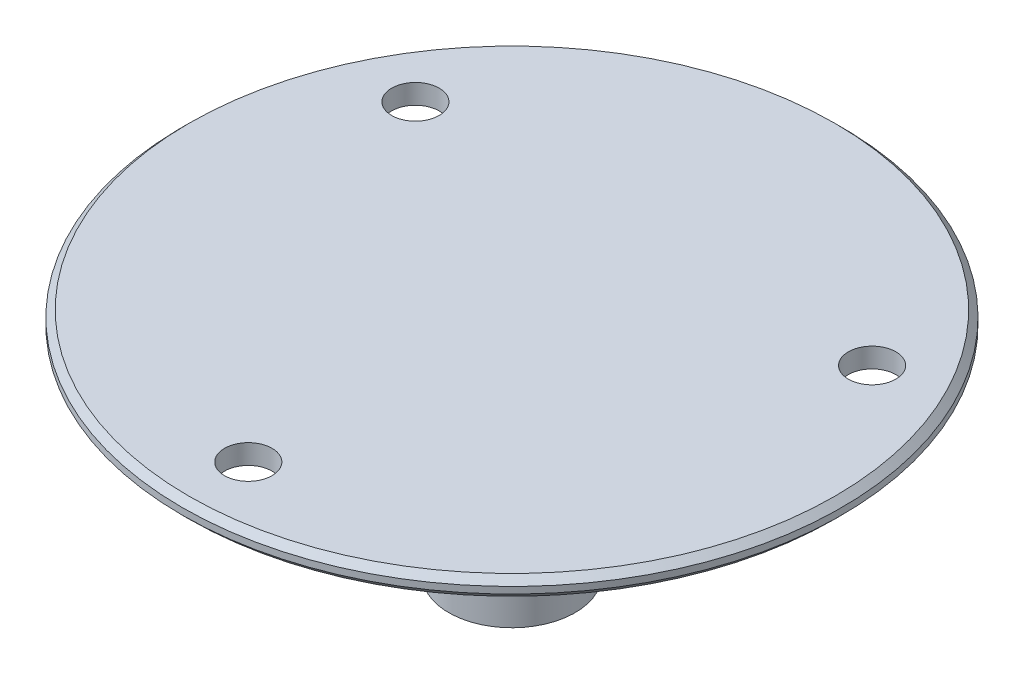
ISO-10303-21;
HEADER;
FILE_DESCRIPTION(('STEP AP214'),'2;1');
FILE_NAME('part.step','',(''),(''),'','','');
FILE_SCHEMA(('AUTOMOTIVE_DESIGN { 1 0 10303 214 1 1 1 1 }'));
ENDSEC;
DATA;
#1=APPLICATION_CONTEXT('core data for automotive mechanical design processes');
#2=APPLICATION_PROTOCOL_DEFINITION('international standard','automotive_design',2000,#1);
#3=PRODUCT_CONTEXT('',#1,'mechanical');
#4=PRODUCT('Part','Part','',(#3));
#5=PRODUCT_RELATED_PRODUCT_CATEGORY('part','',(#4));
#6=PRODUCT_DEFINITION_FORMATION('','',#4);
#7=PRODUCT_DEFINITION_CONTEXT('part definition',#1,'design');
#8=PRODUCT_DEFINITION('design','',#6,#7);
#9=PRODUCT_DEFINITION_SHAPE('','',#8);
#10=(LENGTH_UNIT() NAMED_UNIT(*) SI_UNIT(.MILLI.,.METRE.));
#11=(NAMED_UNIT(*) PLANE_ANGLE_UNIT() SI_UNIT($,.RADIAN.));
#12=(NAMED_UNIT(*) SI_UNIT($,.STERADIAN.) SOLID_ANGLE_UNIT());
#13=UNCERTAINTY_MEASURE_WITH_UNIT(LENGTH_MEASURE(1.E-05),#10,'distance_accuracy_value','');
#14=(GEOMETRIC_REPRESENTATION_CONTEXT(3) GLOBAL_UNCERTAINTY_ASSIGNED_CONTEXT((#13)) GLOBAL_UNIT_ASSIGNED_CONTEXT((#10,
#11,#12)) REPRESENTATION_CONTEXT('',''));
#15=CARTESIAN_POINT('',(0.,0.,0.));
#16=DIRECTION('',(0.,0.,1.));
#17=DIRECTION('',(1.,0.,0.));
#18=AXIS2_PLACEMENT_3D('',#15,#16,#17);
#19=CARTESIAN_POINT('',(0.,1.5,0.));
#20=DIRECTION('',(0.,-1.,0.));
#21=DIRECTION('',(0.,0.,-1.));
#22=AXIS2_PLACEMENT_3D('',#19,#20,#21);
#23=CYLINDRICAL_SURFACE('',#22,25.);
#24=CARTESIAN_POINT('',(0.,0.999999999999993,0.));
#25=DIRECTION('',(0.,1.,0.));
#26=DIRECTION('',(0.,0.,1.));
#27=AXIS2_PLACEMENT_3D('',#24,#25,#26);
#28=CIRCLE('',#27,25.);
#29=CARTESIAN_POINT('',(0.,0.999999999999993,25.));
#30=VERTEX_POINT('',#29);
#31=EDGE_CURVE('E11',#30,#30,#28,.F.);
#32=ORIENTED_EDGE('',*,*,#31,.T.);
#33=EDGE_LOOP('',(#32));
#34=FACE_BOUND('',#33,.T.);
#35=CARTESIAN_POINT('',(0.,0.499999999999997,0.));
#36=DIRECTION('',(0.,1.,0.));
#37=DIRECTION('',(0.,0.,1.));
#38=AXIS2_PLACEMENT_3D('',#35,#36,#37);
#39=CIRCLE('',#38,25.);
#40=CARTESIAN_POINT('',(0.,0.499999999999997,25.));
#41=VERTEX_POINT('',#40);
#42=EDGE_CURVE('E383',#41,#41,#39,.T.);
#43=ORIENTED_EDGE('',*,*,#42,.T.);
#44=EDGE_LOOP('',(#43));
#45=FACE_BOUND('',#44,.T.);
#46=ADVANCED_FACE('F35',(#34,#45),#23,.T.);
#47=CARTESIAN_POINT('',(0.,1.5,0.));
#48=DIRECTION('',(0.,1.,0.));
#49=DIRECTION('',(0.,0.,1.));
#50=AXIS2_PLACEMENT_3D('',#47,#48,#49);
#51=PLANE('',#50);
#52=CARTESIAN_POINT('',(0.,1.5,0.));
#53=DIRECTION('',(0.,1.,0.));
#54=DIRECTION('',(0.,0.,1.));
#55=AXIS2_PLACEMENT_3D('',#52,#53,#54);
#56=CIRCLE('',#55,24.5);
#57=CARTESIAN_POINT('',(0.,1.5,24.5));
#58=VERTEX_POINT('',#57);
#59=EDGE_CURVE('E43',#58,#58,#56,.T.);
#60=ORIENTED_EDGE('',*,*,#59,.T.);
#61=EDGE_LOOP('',(#60));
#62=FACE_BOUND('',#61,.T.);
#63=CARTESIAN_POINT('',(0.,1.5,20.));
#64=DIRECTION('',(0.,1.,0.));
#65=DIRECTION('',(0.,0.,1.));
#66=AXIS2_PLACEMENT_3D('',#63,#64,#65);
#67=CIRCLE('',#66,1.8);
#68=CARTESIAN_POINT('',(0.,1.5,21.8));
#69=VERTEX_POINT('',#68);
#70=EDGE_CURVE('E186',#69,#69,#67,.F.);
#71=ORIENTED_EDGE('',*,*,#70,.T.);
#72=EDGE_LOOP('',(#71));
#73=FACE_BOUND('',#72,.T.);
#74=CARTESIAN_POINT('',(17.3205080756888,1.5,-9.99999999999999));
#75=DIRECTION('',(0.,1.,0.));
#76=DIRECTION('',(0.,0.,1.));
#77=AXIS2_PLACEMENT_3D('',#74,#75,#76);
#78=CIRCLE('',#77,1.8);
#79=CARTESIAN_POINT('',(17.3205080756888,1.5,-8.2));
#80=VERTEX_POINT('',#79);
#81=EDGE_CURVE('E180',#80,#80,#78,.F.);
#82=ORIENTED_EDGE('',*,*,#81,.T.);
#83=EDGE_LOOP('',(#82));
#84=FACE_BOUND('',#83,.T.);
#85=CARTESIAN_POINT('',(-17.3205080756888,1.5,-10.));
#86=DIRECTION('',(0.,1.,0.));
#87=DIRECTION('',(0.,0.,1.));
#88=AXIS2_PLACEMENT_3D('',#85,#86,#87);
#89=CIRCLE('',#88,1.8);
#90=CARTESIAN_POINT('',(-17.3205080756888,1.5,-8.20000000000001));
#91=VERTEX_POINT('',#90);
#92=EDGE_CURVE('E173',#91,#91,#89,.F.);
#93=ORIENTED_EDGE('',*,*,#92,.T.);
#94=EDGE_LOOP('',(#93));
#95=FACE_BOUND('',#94,.T.);
#96=ADVANCED_FACE('F357',(#62,#73,#84,#95),#51,.T.);
#97=CARTESIAN_POINT('',(0.,0.,0.));
#98=DIRECTION('',(0.,1.,0.));
#99=DIRECTION('',(0.,0.,1.));
#100=AXIS2_PLACEMENT_3D('',#97,#98,#99);
#101=PLANE('',#100);
#102=CARTESIAN_POINT('',(0.,0.,0.));
#103=DIRECTION('',(0.,1.,0.));
#104=DIRECTION('',(0.,0.,1.));
#105=AXIS2_PLACEMENT_3D('',#102,#103,#104);
#106=CIRCLE('',#105,24.5);
#107=CARTESIAN_POINT('',(0.,0.,24.5));
#108=VERTEX_POINT('',#107);
#109=EDGE_CURVE('E380',#108,#108,#106,.F.);
#110=ORIENTED_EDGE('',*,*,#109,.T.);
#111=EDGE_LOOP('',(#110));
#112=FACE_BOUND('',#111,.T.);
#113=CARTESIAN_POINT('',(0.,0.,20.));
#114=DIRECTION('',(0.,-1.,0.));
#115=DIRECTION('',(0.,0.,-1.));
#116=AXIS2_PLACEMENT_3D('',#113,#114,#115);
#117=CIRCLE('',#116,1.8);
#118=CARTESIAN_POINT('',(0.,0.,18.2));
#119=VERTEX_POINT('',#118);
#120=EDGE_CURVE('E172',#119,#119,#117,.T.);
#121=ORIENTED_EDGE('',*,*,#120,.F.);
#122=EDGE_LOOP('',(#121));
#123=FACE_BOUND('',#122,.T.);
#124=CARTESIAN_POINT('',(17.3205080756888,0.,-9.99999999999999));
#125=DIRECTION('',(0.,-1.,0.));
#126=DIRECTION('',(0.,0.,-1.));
#127=AXIS2_PLACEMENT_3D('',#124,#125,#126);
#128=CIRCLE('',#127,1.8);
#129=CARTESIAN_POINT('',(17.3205080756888,0.,-11.8));
#130=VERTEX_POINT('',#129);
#131=EDGE_CURVE('E183',#130,#130,#128,.T.);
#132=ORIENTED_EDGE('',*,*,#131,.F.);
#133=EDGE_LOOP('',(#132));
#134=FACE_BOUND('',#133,.T.);
#135=CARTESIAN_POINT('',(-17.3205080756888,0.,-10.));
#136=DIRECTION('',(0.,-1.,0.));
#137=DIRECTION('',(0.,0.,-1.));
#138=AXIS2_PLACEMENT_3D('',#135,#136,#137);
#139=CIRCLE('',#138,1.8);
#140=CARTESIAN_POINT('',(-17.3205080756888,0.,-11.8));
#141=VERTEX_POINT('',#140);
#142=EDGE_CURVE('E176',#141,#141,#139,.T.);
#143=ORIENTED_EDGE('',*,*,#142,.F.);
#144=EDGE_LOOP('',(#143));
#145=FACE_BOUND('',#144,.T.);
#146=CARTESIAN_POINT('',(0.,0.,0.));
#147=DIRECTION('',(0.,-1.,0.));
#148=DIRECTION('',(0.,0.,-1.));
#149=AXIS2_PLACEMENT_3D('',#146,#147,#148);
#150=CIRCLE('',#149,4.8);
#151=CARTESIAN_POINT('',(0.,0.,-4.8));
#152=VERTEX_POINT('',#151);
#153=EDGE_CURVE('E162',#152,#152,#150,.T.);
#154=ORIENTED_EDGE('',*,*,#153,.F.);
#155=EDGE_LOOP('',(#154));
#156=FACE_BOUND('',#155,.T.);
#157=ADVANCED_FACE('F363',(#112,#123,#134,#145,#156),#101,.F.);
#158=CARTESIAN_POINT('',(0.,-16.,0.));
#159=DIRECTION('',(0.,-1.,0.));
#160=DIRECTION('',(0.,0.,-1.));
#161=AXIS2_PLACEMENT_3D('',#158,#159,#160);
#162=PLANE('',#161);
#163=CARTESIAN_POINT('',(0.,-16.,0.));
#164=DIRECTION('',(0.,-1.,0.));
#165=DIRECTION('',(0.,0.,-1.));
#166=AXIS2_PLACEMENT_3D('',#163,#164,#165);
#167=CIRCLE('',#166,3.79999999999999);
#168=CARTESIAN_POINT('',(0.,-16.,-3.79999999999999));
#169=VERTEX_POINT('',#168);
#170=EDGE_CURVE('E384',#169,#169,#167,.F.);
#171=ORIENTED_EDGE('',*,*,#170,.T.);
#172=EDGE_LOOP('',(#171));
#173=FACE_BOUND('',#172,.T.);
#174=CARTESIAN_POINT('',(0.,-16.,0.));
#175=DIRECTION('',(0.,-1.,0.));
#176=DIRECTION('',(0.,0.,-1.));
#177=AXIS2_PLACEMENT_3D('',#174,#175,#176);
#178=CIRCLE('',#177,4.8);
#179=CARTESIAN_POINT('',(0.,-16.,-4.8));
#180=VERTEX_POINT('',#179);
#181=EDGE_CURVE('E164',#180,#180,#178,.T.);
#182=ORIENTED_EDGE('',*,*,#181,.T.);
#183=EDGE_LOOP('',(#182));
#184=FACE_BOUND('',#183,.T.);
#185=ADVANCED_FACE('F251',(#173,#184),#162,.T.);
#186=CARTESIAN_POINT('',(0.,-16.,0.));
#187=DIRECTION('',(0.,1.,0.));
#188=DIRECTION('',(0.,0.,1.));
#189=AXIS2_PLACEMENT_3D('',#186,#187,#188);
#190=CYLINDRICAL_SURFACE('',#189,4.8);
#191=CARTESIAN_POINT('',(0.,-9.,0.));
#192=DIRECTION('',(-0.733212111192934,0.68,0.));
#193=DIRECTION('',(0.68,0.733212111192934,0.));
#194=AXIS2_PLACEMENT_3D('',#191,#192,#193);
#195=ELLIPSE('',#194,7.05882352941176,4.8);
#196=CARTESIAN_POINT('',(0.,-9.,-4.80000000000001));
#197=VERTEX_POINT('',#196);
#198=CARTESIAN_POINT('',(-1.24646058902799,-10.344,-4.63533558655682));
#199=VERTEX_POINT('',#198);
#200=EDGE_CURVE('E295',#197,#199,#195,.T.);
#201=ORIENTED_EDGE('',*,*,#200,.T.);
#202=CARTESIAN_POINT('',(-1.24646058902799,-10.344,-4.63533558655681));
#203=CARTESIAN_POINT('',(-1.27847726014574,-10.3785255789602,-4.62672625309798));
#204=CARTESIAN_POINT('',(-1.30905148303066,-10.4143673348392,-4.61814894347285));
#205=CARTESIAN_POINT('',(-1.36715635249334,-10.4885128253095,-4.60128225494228));
#206=CARTESIAN_POINT('',(-1.39468640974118,-10.5268170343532,-4.59299293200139));
#207=CARTESIAN_POINT('',(-1.47251020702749,-10.645231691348,-4.56888065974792));
#208=CARTESIAN_POINT('',(-1.51796797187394,-10.7287691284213,-4.55383290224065));
#209=CARTESIAN_POINT('',(-1.59454104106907,-10.9029152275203,-4.52759252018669));
#210=CARTESIAN_POINT('',(-1.62562915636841,-10.993536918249,-4.5164072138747));
#211=CARTESIAN_POINT('',(-1.67216898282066,-11.1791013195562,-4.49938600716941));
#212=CARTESIAN_POINT('',(-1.68764276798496,-11.2740377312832,-4.49354255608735));
#213=CARTESIAN_POINT('',(-1.70203605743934,-11.4612093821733,-4.48810972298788));
#214=CARTESIAN_POINT('',(-1.70163938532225,-11.5533850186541,-4.48826199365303));
#215=CARTESIAN_POINT('',(-1.68599568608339,-11.736319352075,-4.49416132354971));
#216=CARTESIAN_POINT('',(-1.67074292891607,-11.8270774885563,-4.49991054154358));
#217=CARTESIAN_POINT('',(-1.62648209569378,-12.0025674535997,-4.51609233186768));
#218=CARTESIAN_POINT('',(-1.59778218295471,-12.0873876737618,-4.52641971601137));
#219=CARTESIAN_POINT('',(-1.52768920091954,-12.2510549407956,-4.5505527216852));
#220=CARTESIAN_POINT('',(-1.48630032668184,-12.3299039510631,-4.56435719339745));
#221=CARTESIAN_POINT('',(-1.41096486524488,-12.4497334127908,-4.5880332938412));
#222=CARTESIAN_POINT('',(-1.3807008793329,-12.4932087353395,-4.59725900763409));
#223=CARTESIAN_POINT('',(-1.31637462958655,-12.5770047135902,-4.61608912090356));
#224=CARTESIAN_POINT('',(-1.28232105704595,-12.6173322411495,-4.62569262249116));
#225=CARTESIAN_POINT('',(-1.24646058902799,-12.656,-4.63533558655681));
#226=B_SPLINE_CURVE_WITH_KNOTS('',3,(#202,#203,#204,#205,#206,#207,#208,#209,#210,#211,#212,
#213,#214,#215,#216,#217,#218,#219,#220,#221,#222,#223,#224,#225),.UNSPECIFIED.,.F.,.F.,(4,2,2,
2,2,2,2,2,2,2,2,4),(0.,0.143516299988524,0.287060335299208,0.574457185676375,0.862395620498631,
1.14992642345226,1.42508205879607,1.70034386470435,1.96958494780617,2.23873711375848,
2.39983825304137,2.56057724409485),.UNSPECIFIED.);
#227=CARTESIAN_POINT('',(-1.24646058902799,-12.656,-4.63533558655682));
#228=VERTEX_POINT('',#227);
#229=EDGE_CURVE('E199',#199,#228,#226,.T.);
#230=ORIENTED_EDGE('',*,*,#229,.T.);
#231=CARTESIAN_POINT('',(0.,-14.,0.));
#232=DIRECTION('',(-0.733212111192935,-0.679999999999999,0.));
#233=DIRECTION('',(-0.679999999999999,0.733212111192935,0.));
#234=AXIS2_PLACEMENT_3D('',#231,#232,#233);
#235=ELLIPSE('',#234,7.05882352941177,4.8);
#236=CARTESIAN_POINT('',(0.,-14.,-4.80000000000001));
#237=VERTEX_POINT('',#236);
#238=EDGE_CURVE('E328',#228,#237,#235,.T.);
#239=ORIENTED_EDGE('',*,*,#238,.T.);
#240=CARTESIAN_POINT('',(0.,-14.,0.));
#241=DIRECTION('',(0.733212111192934,-0.68,0.));
#242=DIRECTION('',(0.68,0.733212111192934,0.));
#243=AXIS2_PLACEMENT_3D('',#240,#241,#242);
#244=ELLIPSE('',#243,7.05882352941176,4.8);
#245=CARTESIAN_POINT('',(1.24646058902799,-12.656,-4.63533558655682));
#246=VERTEX_POINT('',#245);
#247=EDGE_CURVE('E139',#237,#246,#244,.T.);
#248=ORIENTED_EDGE('',*,*,#247,.T.);
#249=CARTESIAN_POINT('',(1.24646058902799,-12.656,-4.63533558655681));
#250=CARTESIAN_POINT('',(1.27847726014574,-12.6214744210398,-4.62672625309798));
#251=CARTESIAN_POINT('',(1.30905148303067,-12.5856326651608,-4.61814894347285));
#252=CARTESIAN_POINT('',(1.36715635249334,-12.5114871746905,-4.60128225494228));
#253=CARTESIAN_POINT('',(1.39468640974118,-12.4731829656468,-4.59299293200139));
#254=CARTESIAN_POINT('',(1.47251020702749,-12.354768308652,-4.56888065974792));
#255=CARTESIAN_POINT('',(1.51796797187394,-12.2712308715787,-4.55383290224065));
#256=CARTESIAN_POINT('',(1.59454104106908,-12.0970847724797,-4.52759252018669));
#257=CARTESIAN_POINT('',(1.62562915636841,-12.006463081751,-4.5164072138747));
#258=CARTESIAN_POINT('',(1.67216898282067,-11.8208986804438,-4.49938600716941));
#259=CARTESIAN_POINT('',(1.68764276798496,-11.7259622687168,-4.49354255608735));
#260=CARTESIAN_POINT('',(1.70203605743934,-11.5387906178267,-4.48810972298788));
#261=CARTESIAN_POINT('',(1.70163938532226,-11.4466149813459,-4.48826199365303));
#262=CARTESIAN_POINT('',(1.6859956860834,-11.263680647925,-4.49416132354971));
#263=CARTESIAN_POINT('',(1.67074292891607,-11.1729225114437,-4.49991054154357));
#264=CARTESIAN_POINT('',(1.62648209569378,-10.9974325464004,-4.51609233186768));
#265=CARTESIAN_POINT('',(1.59778218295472,-10.9126123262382,-4.52641971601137));
#266=CARTESIAN_POINT('',(1.52768920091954,-10.7489450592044,-4.5505527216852));
#267=CARTESIAN_POINT('',(1.48630032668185,-10.6700960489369,-4.56435719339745));
#268=CARTESIAN_POINT('',(1.41096486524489,-10.5502665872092,-4.5880332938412));
#269=CARTESIAN_POINT('',(1.38070087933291,-10.5067912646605,-4.59725900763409));
#270=CARTESIAN_POINT('',(1.31637462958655,-10.4229952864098,-4.61608912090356));
#271=CARTESIAN_POINT('',(1.28232105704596,-10.3826677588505,-4.62569262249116));
#272=CARTESIAN_POINT('',(1.24646058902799,-10.344,-4.63533558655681));
#273=B_SPLINE_CURVE_WITH_KNOTS('',3,(#249,#250,#251,#252,#253,#254,#255,#256,#257,#258,#259,
#260,#261,#262,#263,#264,#265,#266,#267,#268,#269,#270,#271,#272),.UNSPECIFIED.,.F.,.F.,(4,2,2,
2,2,2,2,2,2,2,2,4),(0.,0.143516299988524,0.287060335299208,0.574457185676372,0.862395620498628,
1.14992642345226,1.42508205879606,1.70034386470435,1.96958494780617,2.23873711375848,
2.39983825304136,2.56057724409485),.UNSPECIFIED.);
#274=CARTESIAN_POINT('',(1.24646058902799,-10.344,-4.63533558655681));
#275=VERTEX_POINT('',#274);
#276=EDGE_CURVE('E274',#246,#275,#273,.T.);
#277=ORIENTED_EDGE('',*,*,#276,.T.);
#278=CARTESIAN_POINT('',(0.,-9.,0.));
#279=DIRECTION('',(0.733212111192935,0.679999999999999,0.));
#280=DIRECTION('',(-0.679999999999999,0.733212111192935,0.));
#281=AXIS2_PLACEMENT_3D('',#278,#279,#280);
#282=ELLIPSE('',#281,7.05882352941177,4.8);
#283=EDGE_CURVE('E290',#275,#197,#282,.T.);
#284=ORIENTED_EDGE('',*,*,#283,.T.);
#285=EDGE_LOOP('',(#201,#230,#239,#248,#277,#284));
#286=FACE_BOUND('',#285,.T.);
#287=CARTESIAN_POINT('',(0.,-14.,4.79999999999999));
#288=VERTEX_POINT('',#287);
#289=CARTESIAN_POINT('',(-1.24646058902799,-12.656,4.63533558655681));
#290=VERTEX_POINT('',#289);
#291=EDGE_CURVE('E327',#288,#290,#235,.T.);
#292=ORIENTED_EDGE('',*,*,#291,.T.);
#293=CARTESIAN_POINT('',(-1.24646058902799,-12.656,4.63533558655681));
#294=CARTESIAN_POINT('',(-1.27847726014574,-12.6214744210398,4.62672625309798));
#295=CARTESIAN_POINT('',(-1.30905148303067,-12.5856326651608,4.61814894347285));
#296=CARTESIAN_POINT('',(-1.36715635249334,-12.5114871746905,4.60128225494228));
#297=CARTESIAN_POINT('',(-1.39468640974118,-12.4731829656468,4.59299293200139));
#298=CARTESIAN_POINT('',(-1.47251020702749,-12.354768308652,4.56888065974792));
#299=CARTESIAN_POINT('',(-1.51796797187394,-12.2712308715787,4.55383290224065));
#300=CARTESIAN_POINT('',(-1.59454104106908,-12.0970847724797,4.52759252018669));
#301=CARTESIAN_POINT('',(-1.62562915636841,-12.006463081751,4.5164072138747));
#302=CARTESIAN_POINT('',(-1.67216898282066,-11.8208986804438,4.49938600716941));
#303=CARTESIAN_POINT('',(-1.68764276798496,-11.7259622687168,4.49354255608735));
#304=CARTESIAN_POINT('',(-1.70203605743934,-11.5387906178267,4.48810972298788));
#305=CARTESIAN_POINT('',(-1.70163938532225,-11.4466149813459,4.48826199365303));
#306=CARTESIAN_POINT('',(-1.68599568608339,-11.263680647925,4.49416132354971));
#307=CARTESIAN_POINT('',(-1.67074292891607,-11.1729225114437,4.49991054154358));
#308=CARTESIAN_POINT('',(-1.62648209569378,-10.9974325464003,4.51609233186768));
#309=CARTESIAN_POINT('',(-1.59778218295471,-10.9126123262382,4.52641971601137));
#310=CARTESIAN_POINT('',(-1.52768920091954,-10.7489450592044,4.5505527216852));
#311=CARTESIAN_POINT('',(-1.48630032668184,-10.6700960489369,4.56435719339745));
#312=CARTESIAN_POINT('',(-1.41096486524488,-10.5502665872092,4.5880332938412));
#313=CARTESIAN_POINT('',(-1.3807008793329,-10.5067912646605,4.59725900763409));
#314=CARTESIAN_POINT('',(-1.31637462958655,-10.4229952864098,4.61608912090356));
#315=CARTESIAN_POINT('',(-1.28232105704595,-10.3826677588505,4.62569262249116));
#316=CARTESIAN_POINT('',(-1.24646058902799,-10.344,4.63533558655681));
#317=B_SPLINE_CURVE_WITH_KNOTS('',3,(#293,#294,#295,#296,#297,#298,#299,#300,#301,#302,#303,
#304,#305,#306,#307,#308,#309,#310,#311,#312,#313,#314,#315,#316),.UNSPECIFIED.,.F.,.F.,(4,2,2,
2,2,2,2,2,2,2,2,4),(0.,0.143516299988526,0.28706033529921,0.574457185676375,0.86239562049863,
1.14992642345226,1.42508205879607,1.70034386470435,1.96958494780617,2.23873711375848,
2.39983825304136,2.56057724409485),.UNSPECIFIED.);
#318=CARTESIAN_POINT('',(-1.24646058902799,-10.344,4.63533558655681));
#319=VERTEX_POINT('',#318);
#320=EDGE_CURVE('E177',#290,#319,#317,.T.);
#321=ORIENTED_EDGE('',*,*,#320,.T.);
#322=CARTESIAN_POINT('',(0.,-9.,4.79999999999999));
#323=VERTEX_POINT('',#322);
#324=EDGE_CURVE('E293',#319,#323,#195,.T.);
#325=ORIENTED_EDGE('',*,*,#324,.T.);
#326=CARTESIAN_POINT('',(1.24646058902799,-10.344,4.63533558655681));
#327=VERTEX_POINT('',#326);
#328=EDGE_CURVE('E292',#323,#327,#282,.T.);
#329=ORIENTED_EDGE('',*,*,#328,.T.);
#330=CARTESIAN_POINT('',(1.24646058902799,-10.344,4.63533558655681));
#331=CARTESIAN_POINT('',(1.27847726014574,-10.3785255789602,4.62672625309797));
#332=CARTESIAN_POINT('',(1.30905148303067,-10.4143673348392,4.61814894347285));
#333=CARTESIAN_POINT('',(1.36715635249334,-10.4885128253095,4.60128225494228));
#334=CARTESIAN_POINT('',(1.39468640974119,-10.5268170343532,4.59299293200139));
#335=CARTESIAN_POINT('',(1.47251020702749,-10.645231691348,4.56888065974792));
#336=CARTESIAN_POINT('',(1.51796797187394,-10.7287691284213,4.55383290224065));
#337=CARTESIAN_POINT('',(1.59454104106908,-10.9029152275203,4.52759252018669));
#338=CARTESIAN_POINT('',(1.62562915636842,-10.993536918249,4.5164072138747));
#339=CARTESIAN_POINT('',(1.67216898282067,-11.1791013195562,4.49938600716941));
#340=CARTESIAN_POINT('',(1.68764276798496,-11.2740377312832,4.49354255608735));
#341=CARTESIAN_POINT('',(1.70203605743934,-11.4612093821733,4.48810972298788));
#342=CARTESIAN_POINT('',(1.70163938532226,-11.5533850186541,4.48826199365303));
#343=CARTESIAN_POINT('',(1.6859956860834,-11.736319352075,4.49416132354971));
#344=CARTESIAN_POINT('',(1.67074292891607,-11.8270774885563,4.49991054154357));
#345=CARTESIAN_POINT('',(1.62648209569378,-12.0025674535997,4.51609233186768));
#346=CARTESIAN_POINT('',(1.59778218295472,-12.0873876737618,4.52641971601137));
#347=CARTESIAN_POINT('',(1.52768920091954,-12.2510549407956,4.5505527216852));
#348=CARTESIAN_POINT('',(1.48630032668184,-12.3299039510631,4.56435719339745));
#349=CARTESIAN_POINT('',(1.41096486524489,-12.4497334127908,4.5880332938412));
#350=CARTESIAN_POINT('',(1.38070087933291,-12.4932087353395,4.59725900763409));
#351=CARTESIAN_POINT('',(1.31637462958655,-12.5770047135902,4.61608912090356));
#352=CARTESIAN_POINT('',(1.28232105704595,-12.6173322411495,4.62569262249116));
#353=CARTESIAN_POINT('',(1.24646058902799,-12.656,4.63533558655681));
#354=B_SPLINE_CURVE_WITH_KNOTS('',3,(#330,#331,#332,#333,#334,#335,#336,#337,#338,#339,#340,
#341,#342,#343,#344,#345,#346,#347,#348,#349,#350,#351,#352,#353),.UNSPECIFIED.,.F.,.F.,(4,2,2,
2,2,2,2,2,2,2,2,4),(0.,0.143516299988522,0.287060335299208,0.574457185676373,0.862395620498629,
1.14992642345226,1.42508205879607,1.70034386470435,1.96958494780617,2.23873711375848,
2.39983825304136,2.56057724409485),.UNSPECIFIED.);
#355=CARTESIAN_POINT('',(1.24646058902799,-12.656,4.63533558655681));
#356=VERTEX_POINT('',#355);
#357=EDGE_CURVE('E281',#327,#356,#354,.T.);
#358=ORIENTED_EDGE('',*,*,#357,.T.);
#359=EDGE_CURVE('E282',#356,#288,#244,.T.);
#360=ORIENTED_EDGE('',*,*,#359,.T.);
#361=EDGE_LOOP('',(#292,#321,#325,#329,#358,#360));
#362=FACE_BOUND('',#361,.T.);
#363=ORIENTED_EDGE('',*,*,#181,.F.);
#364=EDGE_LOOP('',(#363));
#365=FACE_BOUND('',#364,.T.);
#366=ORIENTED_EDGE('',*,*,#153,.T.);
#367=EDGE_LOOP('',(#366));
#368=FACE_BOUND('',#367,.T.);
#369=ADVANCED_FACE('F205',(#286,#362,#365,#368),#190,.T.);
#370=CARTESIAN_POINT('',(0.,-16.,0.));
#371=DIRECTION('',(0.,1.,0.));
#372=DIRECTION('',(0.,0.,1.));
#373=AXIS2_PLACEMENT_3D('',#370,#371,#372);
#374=CYLINDRICAL_SURFACE('',#373,3.3);
#375=CARTESIAN_POINT('',(0.,-15.5,0.));
#376=DIRECTION('',(0.,-1.,0.));
#377=DIRECTION('',(0.,0.,-1.));
#378=AXIS2_PLACEMENT_3D('',#375,#376,#377);
#379=CIRCLE('',#378,3.3);
#380=CARTESIAN_POINT('',(0.,-15.5,-3.3));
#381=VERTEX_POINT('',#380);
#382=EDGE_CURVE('E237',#381,#381,#379,.T.);
#383=ORIENTED_EDGE('',*,*,#382,.T.);
#384=EDGE_LOOP('',(#383));
#385=FACE_BOUND('',#384,.T.);
#386=CARTESIAN_POINT('',(-1.24646058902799,-10.344,-3.05554185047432));
#387=CARTESIAN_POINT('',(-1.30961010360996,-10.4120794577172,-3.02979417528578));
#388=CARTESIAN_POINT('',(-1.36723412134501,-10.4854180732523,-3.0039846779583));
#389=CARTESIAN_POINT('',(-1.47037193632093,-10.6416184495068,-2.95487358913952));
#390=CARTESIAN_POINT('',(-1.5158063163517,-10.7245378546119,-2.93158900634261));
#391=CARTESIAN_POINT('',(-1.59280377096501,-10.8983116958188,-2.89048480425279));
#392=CARTESIAN_POINT('',(-1.62431644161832,-10.9891935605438,-2.87268511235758));
#393=CARTESIAN_POINT('',(-1.67158643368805,-11.175926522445,-2.84544605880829));
#394=CARTESIAN_POINT('',(-1.68739636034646,-11.2717598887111,-2.83597879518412));
#395=CARTESIAN_POINT('',(-1.70167949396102,-11.4557468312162,-2.82742713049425));
#396=CARTESIAN_POINT('',(-1.70169079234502,-11.5437396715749,-2.82742156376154));
#397=CARTESIAN_POINT('',(-1.68819281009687,-11.7183465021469,-2.83550075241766));
#398=CARTESIAN_POINT('',(-1.67467560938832,-11.8049596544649,-2.84359024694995));
#399=CARTESIAN_POINT('',(-1.63595803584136,-11.9694604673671,-2.86602515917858));
#400=CARTESIAN_POINT('',(-1.61144726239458,-12.0475656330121,-2.87999870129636));
#401=CARTESIAN_POINT('',(-1.55192092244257,-12.1986693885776,-2.91250522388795));
#402=CARTESIAN_POINT('',(-1.51690027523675,-12.2716654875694,-2.93104040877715));
#403=CARTESIAN_POINT('',(-1.44465657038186,-12.3984835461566,-2.96720085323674));
#404=CARTESIAN_POINT('',(-1.40902841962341,-12.4533601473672,-2.98436444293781));
#405=CARTESIAN_POINT('',(-1.33198148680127,-12.5583219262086,-3.01953967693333));
#406=CARTESIAN_POINT('',(-1.29058042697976,-12.6084210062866,-3.03754861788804));
#407=CARTESIAN_POINT('',(-1.24646058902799,-12.656,-3.05554185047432));
#408=B_SPLINE_CURVE_WITH_KNOTS('',3,(#386,#387,#388,#389,#390,#391,#392,#393,#394,#395,#396,
#397,#398,#399,#400,#401,#402,#403,#404,#405,#406,#407),.UNSPECIFIED.,.F.,.F.,(4,2,2,2,2,2,2,2,
2,2,4),(0.,0.28897473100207,0.579788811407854,0.871647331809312,1.16252477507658,
1.42508136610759,1.68779175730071,1.93593074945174,2.18418989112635,2.38670351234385,
2.58860859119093),.UNSPECIFIED.);
#409=CARTESIAN_POINT('',(-1.24646058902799,-10.344,-3.05554185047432));
#410=VERTEX_POINT('',#409);
#411=CARTESIAN_POINT('',(-1.24646058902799,-12.656,-3.05554185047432));
#412=VERTEX_POINT('',#411);
#413=EDGE_CURVE('E231',#410,#412,#408,.T.);
#414=ORIENTED_EDGE('',*,*,#413,.F.);
#415=CARTESIAN_POINT('',(0.,-9.,0.));
#416=DIRECTION('',(-0.733212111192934,0.68,0.));
#417=DIRECTION('',(0.68,0.733212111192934,0.));
#418=AXIS2_PLACEMENT_3D('',#415,#416,#417);
#419=ELLIPSE('',#418,4.85294117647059,3.3);
#420=CARTESIAN_POINT('',(0.,-9.,-3.30000000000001));
#421=VERTEX_POINT('',#420);
#422=EDGE_CURVE('E238',#421,#410,#419,.T.);
#423=ORIENTED_EDGE('',*,*,#422,.F.);
#424=CARTESIAN_POINT('',(0.,-9.,0.));
#425=DIRECTION('',(0.733212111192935,0.679999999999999,0.));
#426=DIRECTION('',(-0.679999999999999,0.733212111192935,0.));
#427=AXIS2_PLACEMENT_3D('',#424,#425,#426);
#428=ELLIPSE('',#427,4.85294117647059,3.3);
#429=CARTESIAN_POINT('',(1.24646058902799,-10.344,-3.05554185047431));
#430=VERTEX_POINT('',#429);
#431=EDGE_CURVE('E151',#430,#421,#428,.T.);
#432=ORIENTED_EDGE('',*,*,#431,.F.);
#433=CARTESIAN_POINT('',(1.24646058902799,-12.656,-3.05554185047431));
#434=CARTESIAN_POINT('',(1.30961010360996,-12.5879205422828,-3.02979417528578));
#435=CARTESIAN_POINT('',(1.36723412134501,-12.5145819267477,-3.00398467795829));
#436=CARTESIAN_POINT('',(1.47037193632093,-12.3583815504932,-2.95487358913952));
#437=CARTESIAN_POINT('',(1.51580631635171,-12.2754621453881,-2.93158900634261));
#438=CARTESIAN_POINT('',(1.59280377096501,-12.1016883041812,-2.89048480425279));
#439=CARTESIAN_POINT('',(1.62431644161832,-12.0108064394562,-2.87268511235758));
#440=CARTESIAN_POINT('',(1.67158643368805,-11.824073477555,-2.84544605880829));
#441=CARTESIAN_POINT('',(1.68739636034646,-11.7282401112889,-2.83597879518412));
#442=CARTESIAN_POINT('',(1.70167949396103,-11.5442531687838,-2.82742713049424));
#443=CARTESIAN_POINT('',(1.70169079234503,-11.4562603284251,-2.82742156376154));
#444=CARTESIAN_POINT('',(1.68819281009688,-11.2816534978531,-2.83550075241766));
#445=CARTESIAN_POINT('',(1.67467560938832,-11.1950403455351,-2.84359024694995));
#446=CARTESIAN_POINT('',(1.63595803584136,-11.0305395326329,-2.86602515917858));
#447=CARTESIAN_POINT('',(1.61144726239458,-10.9524343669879,-2.87999870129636));
#448=CARTESIAN_POINT('',(1.55192092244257,-10.8013306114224,-2.91250522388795));
#449=CARTESIAN_POINT('',(1.51690027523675,-10.7283345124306,-2.93104040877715));
#450=CARTESIAN_POINT('',(1.44465657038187,-10.6015164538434,-2.96720085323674));
#451=CARTESIAN_POINT('',(1.40902841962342,-10.5466398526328,-2.98436444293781));
#452=CARTESIAN_POINT('',(1.33198148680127,-10.4416780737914,-3.01953967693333));
#453=CARTESIAN_POINT('',(1.29058042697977,-10.3915789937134,-3.03754861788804));
#454=CARTESIAN_POINT('',(1.24646058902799,-10.344,-3.05554185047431));
#455=B_SPLINE_CURVE_WITH_KNOTS('',3,(#433,#434,#435,#436,#437,#438,#439,#440,#441,#442,#443,
#444,#445,#446,#447,#448,#449,#450,#451,#452,#453,#454),.UNSPECIFIED.,.F.,.F.,(4,2,2,2,2,2,2,2,
2,2,4),(0.,0.28897473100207,0.579788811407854,0.871647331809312,1.16252477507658,
1.42508136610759,1.68779175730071,1.93593074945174,2.18418989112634,2.38670351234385,
2.58860859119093),.UNSPECIFIED.);
#456=CARTESIAN_POINT('',(1.24646058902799,-12.656,-3.05554185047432));
#457=VERTEX_POINT('',#456);
#458=EDGE_CURVE('E148',#457,#430,#455,.T.);
#459=ORIENTED_EDGE('',*,*,#458,.F.);
#460=CARTESIAN_POINT('',(0.,-14.,0.));
#461=DIRECTION('',(0.733212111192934,-0.68,0.));
#462=DIRECTION('',(0.68,0.733212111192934,0.));
#463=AXIS2_PLACEMENT_3D('',#460,#461,#462);
#464=ELLIPSE('',#463,4.85294117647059,3.3);
#465=CARTESIAN_POINT('',(0.,-14.,-3.30000000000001));
#466=VERTEX_POINT('',#465);
#467=EDGE_CURVE('E130',#466,#457,#464,.T.);
#468=ORIENTED_EDGE('',*,*,#467,.F.);
#469=CARTESIAN_POINT('',(0.,-14.,0.));
#470=DIRECTION('',(-0.733212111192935,-0.679999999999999,0.));
#471=DIRECTION('',(-0.679999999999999,0.733212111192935,0.));
#472=AXIS2_PLACEMENT_3D('',#469,#470,#471);
#473=ELLIPSE('',#472,4.85294117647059,3.3);
#474=EDGE_CURVE('E122',#412,#466,#473,.T.);
#475=ORIENTED_EDGE('',*,*,#474,.F.);
#476=EDGE_LOOP('',(#414,#423,#432,#459,#468,#475));
#477=FACE_BOUND('',#476,.T.);
#478=CARTESIAN_POINT('',(-1.24646058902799,-12.656,3.05554185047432));
#479=CARTESIAN_POINT('',(-1.30961010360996,-12.5879205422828,3.02979417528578));
#480=CARTESIAN_POINT('',(-1.36723412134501,-12.5145819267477,3.0039846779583));
#481=CARTESIAN_POINT('',(-1.47037193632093,-12.3583815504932,2.95487358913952));
#482=CARTESIAN_POINT('',(-1.51580631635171,-12.2754621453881,2.93158900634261));
#483=CARTESIAN_POINT('',(-1.59280377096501,-12.1016883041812,2.89048480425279));
#484=CARTESIAN_POINT('',(-1.62431644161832,-12.0108064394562,2.87268511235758));
#485=CARTESIAN_POINT('',(-1.67158643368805,-11.824073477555,2.84544605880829));
#486=CARTESIAN_POINT('',(-1.68739636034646,-11.7282401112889,2.83597879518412));
#487=CARTESIAN_POINT('',(-1.70167949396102,-11.5442531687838,2.82742713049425));
#488=CARTESIAN_POINT('',(-1.70169079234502,-11.4562603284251,2.82742156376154));
#489=CARTESIAN_POINT('',(-1.68819281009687,-11.2816534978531,2.83550075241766));
#490=CARTESIAN_POINT('',(-1.67467560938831,-11.1950403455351,2.84359024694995));
#491=CARTESIAN_POINT('',(-1.63595803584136,-11.0305395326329,2.86602515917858));
#492=CARTESIAN_POINT('',(-1.61144726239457,-10.9524343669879,2.87999870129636));
#493=CARTESIAN_POINT('',(-1.55192092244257,-10.8013306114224,2.91250522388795));
#494=CARTESIAN_POINT('',(-1.51690027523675,-10.7283345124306,2.93104040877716));
#495=CARTESIAN_POINT('',(-1.44465657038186,-10.6015164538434,2.96720085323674));
#496=CARTESIAN_POINT('',(-1.40902841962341,-10.5466398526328,2.98436444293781));
#497=CARTESIAN_POINT('',(-1.33198148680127,-10.4416780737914,3.01953967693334));
#498=CARTESIAN_POINT('',(-1.29058042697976,-10.3915789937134,3.03754861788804));
#499=CARTESIAN_POINT('',(-1.24646058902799,-10.344,3.05554185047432));
#500=B_SPLINE_CURVE_WITH_KNOTS('',3,(#478,#479,#480,#481,#482,#483,#484,#485,#486,#487,#488,
#489,#490,#491,#492,#493,#494,#495,#496,#497,#498,#499),.UNSPECIFIED.,.F.,.F.,(4,2,2,2,2,2,2,2,
2,2,4),(0.,0.28897473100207,0.579788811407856,0.871647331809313,1.16252477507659,
1.42508136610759,1.68779175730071,1.93593074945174,2.18418989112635,2.38670351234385,
2.58860859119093),.UNSPECIFIED.);
#501=CARTESIAN_POINT('',(-1.24646058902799,-12.656,3.05554185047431));
#502=VERTEX_POINT('',#501);
#503=CARTESIAN_POINT('',(-1.24646058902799,-10.344,3.05554185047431));
#504=VERTEX_POINT('',#503);
#505=EDGE_CURVE('E131',#502,#504,#500,.T.);
#506=ORIENTED_EDGE('',*,*,#505,.F.);
#507=CARTESIAN_POINT('',(0.,-14.,3.29999999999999));
#508=VERTEX_POINT('',#507);
#509=EDGE_CURVE('E133',#508,#502,#473,.T.);
#510=ORIENTED_EDGE('',*,*,#509,.F.);
#511=CARTESIAN_POINT('',(1.24646058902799,-12.656,3.05554185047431));
#512=VERTEX_POINT('',#511);
#513=EDGE_CURVE('E150',#512,#508,#464,.T.);
#514=ORIENTED_EDGE('',*,*,#513,.F.);
#515=CARTESIAN_POINT('',(1.24646058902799,-10.344,3.05554185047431));
#516=CARTESIAN_POINT('',(1.30961010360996,-10.4120794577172,3.02979417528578));
#517=CARTESIAN_POINT('',(1.36723412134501,-10.4854180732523,3.00398467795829));
#518=CARTESIAN_POINT('',(1.47037193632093,-10.6416184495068,2.95487358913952));
#519=CARTESIAN_POINT('',(1.51580631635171,-10.7245378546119,2.93158900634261));
#520=CARTESIAN_POINT('',(1.59280377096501,-10.8983116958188,2.89048480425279));
#521=CARTESIAN_POINT('',(1.62431644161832,-10.9891935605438,2.87268511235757));
#522=CARTESIAN_POINT('',(1.67158643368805,-11.175926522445,2.84544605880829));
#523=CARTESIAN_POINT('',(1.68739636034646,-11.2717598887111,2.83597879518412));
#524=CARTESIAN_POINT('',(1.70167949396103,-11.4557468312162,2.82742713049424));
#525=CARTESIAN_POINT('',(1.70169079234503,-11.5437396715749,2.82742156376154));
#526=CARTESIAN_POINT('',(1.68819281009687,-11.7183465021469,2.83550075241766));
#527=CARTESIAN_POINT('',(1.67467560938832,-11.8049596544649,2.84359024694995));
#528=CARTESIAN_POINT('',(1.63595803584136,-11.9694604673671,2.86602515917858));
#529=CARTESIAN_POINT('',(1.61144726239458,-12.0475656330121,2.87999870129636));
#530=CARTESIAN_POINT('',(1.55192092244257,-12.1986693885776,2.91250522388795));
#531=CARTESIAN_POINT('',(1.51690027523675,-12.2716654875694,2.93104040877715));
#532=CARTESIAN_POINT('',(1.44465657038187,-12.3984835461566,2.96720085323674));
#533=CARTESIAN_POINT('',(1.40902841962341,-12.4533601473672,2.98436444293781));
#534=CARTESIAN_POINT('',(1.33198148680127,-12.5583219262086,3.01953967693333));
#535=CARTESIAN_POINT('',(1.29058042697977,-12.6084210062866,3.03754861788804));
#536=CARTESIAN_POINT('',(1.24646058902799,-12.656,3.05554185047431));
#537=B_SPLINE_CURVE_WITH_KNOTS('',3,(#515,#516,#517,#518,#519,#520,#521,#522,#523,#524,#525,
#526,#527,#528,#529,#530,#531,#532,#533,#534,#535,#536),.UNSPECIFIED.,.F.,.F.,(4,2,2,2,2,2,2,2,
2,2,4),(0.,0.28897473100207,0.579788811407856,0.871647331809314,1.16252477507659,
1.42508136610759,1.68779175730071,1.93593074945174,2.18418989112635,2.38670351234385,
2.58860859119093),.UNSPECIFIED.);
#538=CARTESIAN_POINT('',(1.24646058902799,-10.344,3.05554185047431));
#539=VERTEX_POINT('',#538);
#540=EDGE_CURVE('E155',#539,#512,#537,.T.);
#541=ORIENTED_EDGE('',*,*,#540,.F.);
#542=CARTESIAN_POINT('',(0.,-9.,3.29999999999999));
#543=VERTEX_POINT('',#542);
#544=EDGE_CURVE('E161',#543,#539,#428,.T.);
#545=ORIENTED_EDGE('',*,*,#544,.F.);
#546=EDGE_CURVE('E314',#504,#543,#419,.T.);
#547=ORIENTED_EDGE('',*,*,#546,.F.);
#548=EDGE_LOOP('',(#506,#510,#514,#541,#545,#547));
#549=FACE_BOUND('',#548,.T.);
#550=CARTESIAN_POINT('',(0.,0.,0.));
#551=DIRECTION('',(0.,-1.,0.));
#552=DIRECTION('',(0.,0.,-1.));
#553=AXIS2_PLACEMENT_3D('',#550,#551,#552);
#554=CIRCLE('',#553,3.3);
#555=CARTESIAN_POINT('',(0.,0.,-3.3));
#556=VERTEX_POINT('',#555);
#557=EDGE_CURVE('E169',#556,#556,#554,.T.);
#558=ORIENTED_EDGE('',*,*,#557,.F.);
#559=EDGE_LOOP('',(#558));
#560=FACE_BOUND('',#559,.T.);
#561=ADVANCED_FACE('F145',(#385,#477,#549,#560),#374,.F.);
#562=ORIENTED_EDGE('',*,*,#557,.T.);
#563=EDGE_LOOP('',(#562));
#564=FACE_BOUND('',#563,.T.);
#565=ADVANCED_FACE('F248',(#564),#101,.F.);
#566=CARTESIAN_POINT('',(-17.3205080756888,1.501,-10.));
#567=DIRECTION('',(0.,-1.,0.));
#568=DIRECTION('',(0.,0.,-1.));
#569=AXIS2_PLACEMENT_3D('',#566,#567,#568);
#570=CYLINDRICAL_SURFACE('',#569,1.8);
#571=ORIENTED_EDGE('',*,*,#92,.F.);
#572=EDGE_LOOP('',(#571));
#573=FACE_BOUND('',#572,.T.);
#574=ORIENTED_EDGE('',*,*,#142,.T.);
#575=EDGE_LOOP('',(#574));
#576=FACE_BOUND('',#575,.T.);
#577=ADVANCED_FACE('F250',(#573,#576),#570,.F.);
#578=CARTESIAN_POINT('',(17.3205080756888,1.501,-9.99999999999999));
#579=DIRECTION('',(0.,-1.,0.));
#580=DIRECTION('',(0.,0.,-1.));
#581=AXIS2_PLACEMENT_3D('',#578,#579,#580);
#582=CYLINDRICAL_SURFACE('',#581,1.8);
#583=ORIENTED_EDGE('',*,*,#81,.F.);
#584=EDGE_LOOP('',(#583));
#585=FACE_BOUND('',#584,.T.);
#586=ORIENTED_EDGE('',*,*,#131,.T.);
#587=EDGE_LOOP('',(#586));
#588=FACE_BOUND('',#587,.T.);
#589=ADVANCED_FACE('F352',(#585,#588),#582,.F.);
#590=CARTESIAN_POINT('',(0.,1.501,20.));
#591=DIRECTION('',(0.,-1.,0.));
#592=DIRECTION('',(0.,0.,-1.));
#593=AXIS2_PLACEMENT_3D('',#590,#591,#592);
#594=CYLINDRICAL_SURFACE('',#593,1.8);
#595=ORIENTED_EDGE('',*,*,#70,.F.);
#596=EDGE_LOOP('',(#595));
#597=FACE_BOUND('',#596,.T.);
#598=ORIENTED_EDGE('',*,*,#120,.T.);
#599=EDGE_LOOP('',(#598));
#600=FACE_BOUND('',#599,.T.);
#601=ADVANCED_FACE('F218',(#597,#600),#594,.F.);
#602=CARTESIAN_POINT('',(0.,-14.,-25.));
#603=DIRECTION('',(-0.733212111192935,-0.679999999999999,0.));
#604=DIRECTION('',(0.679999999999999,-0.733212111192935,0.));
#605=AXIS2_PLACEMENT_3D('',#602,#603,#604);
#606=PLANE('',#605);
#607=DIRECTION('',(0.,0.,1.));
#608=VECTOR('',#607,1.);
#609=CARTESIAN_POINT('',(0.,-14.,-25.));
#610=LINE('',#609,#608);
#611=EDGE_CURVE('E142',#508,#288,#610,.T.);
#612=ORIENTED_EDGE('',*,*,#611,.F.);
#613=ORIENTED_EDGE('',*,*,#509,.T.);
#614=DIRECTION('',(0.,0.,1.));
#615=VECTOR('',#614,1.);
#616=CARTESIAN_POINT('',(-1.24646058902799,-12.656,-25.));
#617=LINE('',#616,#615);
#618=EDGE_CURVE('E58',#502,#290,#617,.T.);
#619=ORIENTED_EDGE('',*,*,#618,.T.);
#620=ORIENTED_EDGE('',*,*,#291,.F.);
#621=EDGE_LOOP('',(#612,#613,#619,#620));
#622=FACE_BOUND('',#621,.T.);
#623=ADVANCED_FACE('F346',(#622),#606,.F.);
#624=CARTESIAN_POINT('',(0.,-14.,-25.));
#625=DIRECTION('',(0.733212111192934,-0.68,0.));
#626=DIRECTION('',(0.68,0.733212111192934,0.));
#627=AXIS2_PLACEMENT_3D('',#624,#625,#626);
#628=PLANE('',#627);
#629=DIRECTION('',(0.,0.,1.));
#630=VECTOR('',#629,1.);
#631=CARTESIAN_POINT('',(1.24646058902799,-12.656,-25.));
#632=LINE('',#631,#630);
#633=EDGE_CURVE('E141',#512,#356,#632,.T.);
#634=ORIENTED_EDGE('',*,*,#633,.F.);
#635=ORIENTED_EDGE('',*,*,#513,.T.);
#636=ORIENTED_EDGE('',*,*,#611,.T.);
#637=ORIENTED_EDGE('',*,*,#359,.F.);
#638=EDGE_LOOP('',(#634,#635,#636,#637));
#639=FACE_BOUND('',#638,.T.);
#640=ADVANCED_FACE('F265',(#639),#628,.F.);
#641=CARTESIAN_POINT('',(0.,-11.5,-25.));
#642=DIRECTION('',(0.,0.,1.));
#643=DIRECTION('',(1.,0.,0.));
#644=AXIS2_PLACEMENT_3D('',#641,#642,#643);
#645=CYLINDRICAL_SURFACE('',#644,1.7);
#646=DIRECTION('',(0.,0.,1.));
#647=VECTOR('',#646,1.);
#648=CARTESIAN_POINT('',(1.24646058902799,-10.344,-25.));
#649=LINE('',#648,#647);
#650=EDGE_CURVE('E309',#539,#327,#649,.T.);
#651=ORIENTED_EDGE('',*,*,#650,.F.);
#652=ORIENTED_EDGE('',*,*,#540,.T.);
#653=ORIENTED_EDGE('',*,*,#633,.T.);
#654=ORIENTED_EDGE('',*,*,#357,.F.);
#655=EDGE_LOOP('',(#651,#652,#653,#654));
#656=FACE_BOUND('',#655,.T.);
#657=ADVANCED_FACE('F260',(#656),#645,.F.);
#658=CARTESIAN_POINT('',(0.,-9.,-25.));
#659=DIRECTION('',(0.733212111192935,0.679999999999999,0.));
#660=DIRECTION('',(-0.679999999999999,0.733212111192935,0.));
#661=AXIS2_PLACEMENT_3D('',#658,#659,#660);
#662=PLANE('',#661);
#663=DIRECTION('',(0.,0.,1.));
#664=VECTOR('',#663,1.);
#665=CARTESIAN_POINT('',(0.,-9.,-25.));
#666=LINE('',#665,#664);
#667=EDGE_CURVE('E306',#543,#323,#666,.T.);
#668=ORIENTED_EDGE('',*,*,#667,.F.);
#669=ORIENTED_EDGE('',*,*,#544,.T.);
#670=ORIENTED_EDGE('',*,*,#650,.T.);
#671=ORIENTED_EDGE('',*,*,#328,.F.);
#672=EDGE_LOOP('',(#668,#669,#670,#671));
#673=FACE_BOUND('',#672,.T.);
#674=ADVANCED_FACE('F264',(#673),#662,.F.);
#675=CARTESIAN_POINT('',(0.,-9.,-25.));
#676=DIRECTION('',(-0.733212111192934,0.68,0.));
#677=DIRECTION('',(-0.68,-0.733212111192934,0.));
#678=AXIS2_PLACEMENT_3D('',#675,#676,#677);
#679=PLANE('',#678);
#680=DIRECTION('',(0.,0.,1.));
#681=VECTOR('',#680,1.);
#682=CARTESIAN_POINT('',(-1.24646058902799,-10.344,-25.));
#683=LINE('',#682,#681);
#684=EDGE_CURVE('E319',#504,#319,#683,.T.);
#685=ORIENTED_EDGE('',*,*,#684,.F.);
#686=ORIENTED_EDGE('',*,*,#546,.T.);
#687=ORIENTED_EDGE('',*,*,#667,.T.);
#688=ORIENTED_EDGE('',*,*,#324,.F.);
#689=EDGE_LOOP('',(#685,#686,#687,#688));
#690=FACE_BOUND('',#689,.T.);
#691=ADVANCED_FACE('F215',(#690),#679,.F.);
#692=CARTESIAN_POINT('',(0.,-11.5,-25.));
#693=DIRECTION('',(0.,0.,1.));
#694=DIRECTION('',(1.,0.,0.));
#695=AXIS2_PLACEMENT_3D('',#692,#693,#694);
#696=CYLINDRICAL_SURFACE('',#695,1.7);
#697=ORIENTED_EDGE('',*,*,#618,.F.);
#698=ORIENTED_EDGE('',*,*,#505,.T.);
#699=ORIENTED_EDGE('',*,*,#684,.T.);
#700=ORIENTED_EDGE('',*,*,#320,.F.);
#701=EDGE_LOOP('',(#697,#698,#699,#700));
#702=FACE_BOUND('',#701,.T.);
#703=ADVANCED_FACE('F209',(#702),#696,.F.);
#704=EDGE_CURVE('E329',#199,#410,#683,.T.);
#705=ORIENTED_EDGE('',*,*,#704,.T.);
#706=ORIENTED_EDGE('',*,*,#413,.T.);
#707=EDGE_CURVE('E125',#228,#412,#617,.T.);
#708=ORIENTED_EDGE('',*,*,#707,.F.);
#709=ORIENTED_EDGE('',*,*,#229,.F.);
#710=EDGE_LOOP('',(#705,#706,#708,#709));
#711=FACE_BOUND('',#710,.T.);
#712=ADVANCED_FACE('F214',(#711),#696,.F.);
#713=EDGE_CURVE('E315',#197,#421,#666,.T.);
#714=ORIENTED_EDGE('',*,*,#713,.T.);
#715=ORIENTED_EDGE('',*,*,#422,.T.);
#716=ORIENTED_EDGE('',*,*,#704,.F.);
#717=ORIENTED_EDGE('',*,*,#200,.F.);
#718=EDGE_LOOP('',(#714,#715,#716,#717));
#719=FACE_BOUND('',#718,.T.);
#720=ADVANCED_FACE('F342',(#719),#679,.F.);
#721=EDGE_CURVE('E316',#275,#430,#649,.T.);
#722=ORIENTED_EDGE('',*,*,#721,.T.);
#723=ORIENTED_EDGE('',*,*,#431,.T.);
#724=ORIENTED_EDGE('',*,*,#713,.F.);
#725=ORIENTED_EDGE('',*,*,#283,.F.);
#726=EDGE_LOOP('',(#722,#723,#724,#725));
#727=FACE_BOUND('',#726,.T.);
#728=ADVANCED_FACE('F340',(#727),#662,.F.);
#729=EDGE_CURVE('E324',#246,#457,#632,.T.);
#730=ORIENTED_EDGE('',*,*,#729,.T.);
#731=ORIENTED_EDGE('',*,*,#458,.T.);
#732=ORIENTED_EDGE('',*,*,#721,.F.);
#733=ORIENTED_EDGE('',*,*,#276,.F.);
#734=EDGE_LOOP('',(#730,#731,#732,#733));
#735=FACE_BOUND('',#734,.T.);
#736=ADVANCED_FACE('F267',(#735),#645,.F.);
#737=EDGE_CURVE('E50',#237,#466,#610,.T.);
#738=ORIENTED_EDGE('',*,*,#737,.T.);
#739=ORIENTED_EDGE('',*,*,#467,.T.);
#740=ORIENTED_EDGE('',*,*,#729,.F.);
#741=ORIENTED_EDGE('',*,*,#247,.F.);
#742=EDGE_LOOP('',(#738,#739,#740,#741));
#743=FACE_BOUND('',#742,.T.);
#744=ADVANCED_FACE('F135',(#743),#628,.F.);
#745=ORIENTED_EDGE('',*,*,#707,.T.);
#746=ORIENTED_EDGE('',*,*,#474,.T.);
#747=ORIENTED_EDGE('',*,*,#737,.F.);
#748=ORIENTED_EDGE('',*,*,#238,.F.);
#749=EDGE_LOOP('',(#745,#746,#747,#748));
#750=FACE_BOUND('',#749,.T.);
#751=ADVANCED_FACE('F123',(#750),#606,.F.);
#752=CARTESIAN_POINT('',(0.,-15.5,0.));
#753=DIRECTION('',(0.,-1.,0.));
#754=DIRECTION('',(0.,0.,-1.));
#755=AXIS2_PLACEMENT_3D('',#752,#753,#754);
#756=CONICAL_SURFACE('',#755,3.3,0.785398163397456);
#757=ORIENTED_EDGE('',*,*,#170,.F.);
#758=EDGE_LOOP('',(#757));
#759=FACE_BOUND('',#758,.T.);
#760=ORIENTED_EDGE('',*,*,#382,.F.);
#761=EDGE_LOOP('',(#760));
#762=FACE_BOUND('',#761,.T.);
#763=ADVANCED_FACE('F355',(#759,#762),#756,.F.);
#764=CARTESIAN_POINT('',(0.,0.499999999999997,0.));
#765=DIRECTION('',(0.,1.,0.));
#766=DIRECTION('',(0.,0.,1.));
#767=AXIS2_PLACEMENT_3D('',#764,#765,#766);
#768=CONICAL_SURFACE('',#767,25.,0.785398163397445);
#769=ORIENTED_EDGE('',*,*,#109,.F.);
#770=EDGE_LOOP('',(#769));
#771=FACE_BOUND('',#770,.T.);
#772=ORIENTED_EDGE('',*,*,#42,.F.);
#773=EDGE_LOOP('',(#772));
#774=FACE_BOUND('',#773,.T.);
#775=ADVANCED_FACE('F369',(#771,#774),#768,.T.);
#776=CARTESIAN_POINT('',(0.,1.5,0.));
#777=DIRECTION('',(0.,-1.,0.));
#778=DIRECTION('',(0.,0.,-1.));
#779=AXIS2_PLACEMENT_3D('',#776,#777,#778);
#780=CONICAL_SURFACE('',#779,24.5,0.785398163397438);
#781=ORIENTED_EDGE('',*,*,#31,.F.);
#782=EDGE_LOOP('',(#781));
#783=FACE_BOUND('',#782,.T.);
#784=ORIENTED_EDGE('',*,*,#59,.F.);
#785=EDGE_LOOP('',(#784));
#786=FACE_BOUND('',#785,.T.);
#787=ADVANCED_FACE('F37',(#783,#786),#780,.T.);
#788=CLOSED_SHELL('',(#46,#96,#157,#185,#369,#561,#565,#577,#589,#601,#623,#640,#657,#674,#691,
#703,#712,#720,#728,#736,#744,#751,#763,#775,#787));
#789=MANIFOLD_SOLID_BREP('B2',#788);
#790=ADVANCED_BREP_SHAPE_REPRESENTATION('',(#18,#789),#14);
#791=SHAPE_DEFINITION_REPRESENTATION(#9,#790);
ENDSEC;
END-ISO-10303-21;
